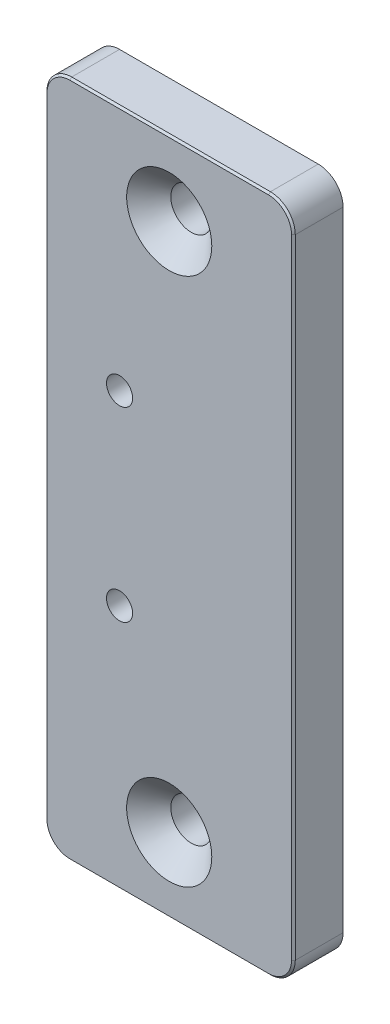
ISO-10303-21;
HEADER;
FILE_DESCRIPTION(('STEP AP214'),'2;1');
FILE_NAME('part.step','',(''),(''),'','','');
FILE_SCHEMA(('AUTOMOTIVE_DESIGN { 1 0 10303 214 1 1 1 1 }'));
ENDSEC;
DATA;
#1=APPLICATION_CONTEXT('core data for automotive mechanical design processes');
#2=APPLICATION_PROTOCOL_DEFINITION('international standard','automotive_design',2000,#1);
#3=PRODUCT_CONTEXT('',#1,'mechanical');
#4=PRODUCT('Part','Part','',(#3));
#5=PRODUCT_RELATED_PRODUCT_CATEGORY('part','',(#4));
#6=PRODUCT_DEFINITION_FORMATION('','',#4);
#7=PRODUCT_DEFINITION_CONTEXT('part definition',#1,'design');
#8=PRODUCT_DEFINITION('design','',#6,#7);
#9=PRODUCT_DEFINITION_SHAPE('','',#8);
#10=(LENGTH_UNIT() NAMED_UNIT(*) SI_UNIT(.MILLI.,.METRE.));
#11=(NAMED_UNIT(*) PLANE_ANGLE_UNIT() SI_UNIT($,.RADIAN.));
#12=(NAMED_UNIT(*) SI_UNIT($,.STERADIAN.) SOLID_ANGLE_UNIT());
#13=UNCERTAINTY_MEASURE_WITH_UNIT(LENGTH_MEASURE(1.E-05),#10,'distance_accuracy_value','');
#14=(GEOMETRIC_REPRESENTATION_CONTEXT(3) GLOBAL_UNCERTAINTY_ASSIGNED_CONTEXT((#13)) GLOBAL_UNIT_ASSIGNED_CONTEXT((#10,
#11,#12)) REPRESENTATION_CONTEXT('',''));
#15=CARTESIAN_POINT('',(0.,0.,0.));
#16=DIRECTION('',(0.,0.,1.));
#17=DIRECTION('',(1.,0.,0.));
#18=AXIS2_PLACEMENT_3D('',#15,#16,#17);
#19=CARTESIAN_POINT('',(0.,97.2,8.));
#20=DIRECTION('',(0.,0.,-1.));
#21=DIRECTION('',(-1.,0.,0.));
#22=AXIS2_PLACEMENT_3D('',#19,#20,#21);
#23=CYLINDRICAL_SURFACE('',#22,3.3);
#24=CARTESIAN_POINT('',(0.,97.2,0.));
#25=DIRECTION('',(0.,0.,1.));
#26=DIRECTION('',(1.,0.,0.));
#27=AXIS2_PLACEMENT_3D('',#24,#25,#26);
#28=CIRCLE('',#27,3.3);
#29=CARTESIAN_POINT('',(3.3,97.2,0.));
#30=VERTEX_POINT('',#29);
#31=EDGE_CURVE('E155',#30,#30,#28,.T.);
#32=ORIENTED_EDGE('',*,*,#31,.F.);
#33=EDGE_LOOP('',(#32));
#34=FACE_BOUND('',#33,.T.);
#35=CARTESIAN_POINT('',(0.,97.2,4.445));
#36=DIRECTION('',(0.,0.,1.));
#37=DIRECTION('',(1.,0.,0.));
#38=AXIS2_PLACEMENT_3D('',#35,#36,#37);
#39=CIRCLE('',#38,3.3);
#40=CARTESIAN_POINT('',(3.3,97.2,4.445));
#41=VERTEX_POINT('',#40);
#42=EDGE_CURVE('E241',#41,#41,#39,.T.);
#43=ORIENTED_EDGE('',*,*,#42,.T.);
#44=EDGE_LOOP('',(#43));
#45=FACE_BOUND('',#44,.T.);
#46=ADVANCED_FACE('F39',(#34,#45),#23,.F.);
#47=CARTESIAN_POINT('',(-16.,4.,8.));
#48=DIRECTION('',(0.,0.,1.));
#49=DIRECTION('',(1.,0.,0.));
#50=AXIS2_PLACEMENT_3D('',#47,#48,#49);
#51=PLANE('',#50);
#52=CARTESIAN_POINT('',(-8.,69.6,8.));
#53=DIRECTION('',(0.,0.,1.));
#54=DIRECTION('',(1.,0.,0.));
#55=AXIS2_PLACEMENT_3D('',#52,#53,#54);
#56=CIRCLE('',#55,2.1);
#57=CARTESIAN_POINT('',(-5.9,69.6,8.));
#58=VERTEX_POINT('',#57);
#59=EDGE_CURVE('E508',#58,#58,#56,.T.);
#60=ORIENTED_EDGE('',*,*,#59,.F.);
#61=EDGE_LOOP('',(#60));
#62=FACE_BOUND('',#61,.T.);
#63=CARTESIAN_POINT('',(-8.,39.6,8.));
#64=DIRECTION('',(0.,0.,1.));
#65=DIRECTION('',(1.,0.,0.));
#66=AXIS2_PLACEMENT_3D('',#63,#64,#65);
#67=CIRCLE('',#66,2.1);
#68=CARTESIAN_POINT('',(-5.9,39.6,8.));
#69=VERTEX_POINT('',#68);
#70=EDGE_CURVE('E511',#69,#69,#67,.T.);
#71=ORIENTED_EDGE('',*,*,#70,.F.);
#72=EDGE_LOOP('',(#71));
#73=FACE_BOUND('',#72,.T.);
#74=CARTESIAN_POINT('',(16.,4.,8.));
#75=DIRECTION('',(0.,0.,1.));
#76=DIRECTION('',(1.,0.,0.));
#77=AXIS2_PLACEMENT_3D('',#74,#75,#76);
#78=CIRCLE('',#77,3.69999999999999);
#79=CARTESIAN_POINT('',(16.,0.300000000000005,8.));
#80=VERTEX_POINT('',#79);
#81=CARTESIAN_POINT('',(19.7,4.,8.));
#82=VERTEX_POINT('',#81);
#83=EDGE_CURVE('E195',#80,#82,#78,.T.);
#84=ORIENTED_EDGE('',*,*,#83,.T.);
#85=DIRECTION('',(0.,1.,0.));
#86=VECTOR('',#85,1.);
#87=CARTESIAN_POINT('',(19.7,105.2,8.));
#88=LINE('',#87,#86);
#89=CARTESIAN_POINT('',(19.7,105.2,8.));
#90=VERTEX_POINT('',#89);
#91=EDGE_CURVE('E199',#82,#90,#88,.T.);
#92=ORIENTED_EDGE('',*,*,#91,.T.);
#93=CARTESIAN_POINT('',(16.,105.2,8.));
#94=DIRECTION('',(0.,0.,1.));
#95=DIRECTION('',(1.,0.,0.));
#96=AXIS2_PLACEMENT_3D('',#93,#94,#95);
#97=CIRCLE('',#96,3.69999999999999);
#98=CARTESIAN_POINT('',(16.,108.9,8.));
#99=VERTEX_POINT('',#98);
#100=EDGE_CURVE('E197',#90,#99,#97,.T.);
#101=ORIENTED_EDGE('',*,*,#100,.T.);
#102=DIRECTION('',(-1.,0.,0.));
#103=VECTOR('',#102,1.);
#104=CARTESIAN_POINT('',(-16.,108.9,8.));
#105=LINE('',#104,#103);
#106=CARTESIAN_POINT('',(-16.,108.9,8.));
#107=VERTEX_POINT('',#106);
#108=EDGE_CURVE('E193',#99,#107,#105,.T.);
#109=ORIENTED_EDGE('',*,*,#108,.T.);
#110=CARTESIAN_POINT('',(-16.,105.2,8.));
#111=DIRECTION('',(0.,0.,1.));
#112=DIRECTION('',(1.,0.,0.));
#113=AXIS2_PLACEMENT_3D('',#110,#111,#112);
#114=CIRCLE('',#113,3.69999999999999);
#115=CARTESIAN_POINT('',(-19.7,105.2,8.));
#116=VERTEX_POINT('',#115);
#117=EDGE_CURVE('E189',#107,#116,#114,.T.);
#118=ORIENTED_EDGE('',*,*,#117,.T.);
#119=DIRECTION('',(0.,-1.,0.));
#120=VECTOR('',#119,1.);
#121=CARTESIAN_POINT('',(-19.7,4.,8.));
#122=LINE('',#121,#120);
#123=CARTESIAN_POINT('',(-19.7,4.,8.));
#124=VERTEX_POINT('',#123);
#125=EDGE_CURVE('E136',#116,#124,#122,.T.);
#126=ORIENTED_EDGE('',*,*,#125,.T.);
#127=CARTESIAN_POINT('',(-16.,4.,8.));
#128=DIRECTION('',(0.,0.,1.));
#129=DIRECTION('',(1.,0.,0.));
#130=AXIS2_PLACEMENT_3D('',#127,#128,#129);
#131=CIRCLE('',#130,3.69999999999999);
#132=CARTESIAN_POINT('',(-16.,0.300000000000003,8.));
#133=VERTEX_POINT('',#132);
#134=EDGE_CURVE('E187',#124,#133,#131,.T.);
#135=ORIENTED_EDGE('',*,*,#134,.T.);
#136=DIRECTION('',(1.,0.,0.));
#137=VECTOR('',#136,1.);
#138=CARTESIAN_POINT('',(16.,0.300000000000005,8.));
#139=LINE('',#138,#137);
#140=EDGE_CURVE('E191',#133,#80,#139,.T.);
#141=ORIENTED_EDGE('',*,*,#140,.T.);
#142=EDGE_LOOP('',(#84,#92,#101,#109,#118,#126,#135,#141));
#143=FACE_BOUND('',#142,.T.);
#144=CARTESIAN_POINT('',(0.,97.2,8.));
#145=DIRECTION('',(0.,0.,1.));
#146=DIRECTION('',(1.,0.,0.));
#147=AXIS2_PLACEMENT_3D('',#144,#145,#146);
#148=CIRCLE('',#147,6.855);
#149=CARTESIAN_POINT('',(6.855,97.2,8.));
#150=VERTEX_POINT('',#149);
#151=EDGE_CURVE('E236',#150,#150,#148,.T.);
#152=ORIENTED_EDGE('',*,*,#151,.F.);
#153=EDGE_LOOP('',(#152));
#154=FACE_BOUND('',#153,.T.);
#155=CARTESIAN_POINT('',(0.,12.,8.));
#156=DIRECTION('',(0.,0.,1.));
#157=DIRECTION('',(1.,0.,0.));
#158=AXIS2_PLACEMENT_3D('',#155,#156,#157);
#159=CIRCLE('',#158,6.855);
#160=CARTESIAN_POINT('',(6.855,12.,8.));
#161=VERTEX_POINT('',#160);
#162=EDGE_CURVE('E246',#161,#161,#159,.T.);
#163=ORIENTED_EDGE('',*,*,#162,.F.);
#164=EDGE_LOOP('',(#163));
#165=FACE_BOUND('',#164,.T.);
#166=ADVANCED_FACE('F261',(#62,#73,#143,#154,#165),#51,.T.);
#167=CARTESIAN_POINT('',(-16.,4.,0.));
#168=DIRECTION('',(0.,0.,1.));
#169=DIRECTION('',(1.,0.,0.));
#170=AXIS2_PLACEMENT_3D('',#167,#168,#169);
#171=PLANE('',#170);
#172=CARTESIAN_POINT('',(-8.,69.6,0.));
#173=DIRECTION('',(0.,0.,1.));
#174=DIRECTION('',(1.,0.,0.));
#175=AXIS2_PLACEMENT_3D('',#172,#173,#174);
#176=CIRCLE('',#175,2.1);
#177=CARTESIAN_POINT('',(-5.9,69.6,0.));
#178=VERTEX_POINT('',#177);
#179=EDGE_CURVE('E43',#178,#178,#176,.T.);
#180=ORIENTED_EDGE('',*,*,#179,.T.);
#181=EDGE_LOOP('',(#180));
#182=FACE_BOUND('',#181,.T.);
#183=CARTESIAN_POINT('',(-8.,39.6,0.));
#184=DIRECTION('',(0.,0.,1.));
#185=DIRECTION('',(1.,0.,0.));
#186=AXIS2_PLACEMENT_3D('',#183,#184,#185);
#187=CIRCLE('',#186,2.1);
#188=CARTESIAN_POINT('',(-5.9,39.6,0.));
#189=VERTEX_POINT('',#188);
#190=EDGE_CURVE('E218',#189,#189,#187,.T.);
#191=ORIENTED_EDGE('',*,*,#190,.T.);
#192=EDGE_LOOP('',(#191));
#193=FACE_BOUND('',#192,.T.);
#194=CARTESIAN_POINT('',(-16.,4.,0.));
#195=DIRECTION('',(0.,0.,1.));
#196=DIRECTION('',(1.,0.,0.));
#197=AXIS2_PLACEMENT_3D('',#194,#195,#196);
#198=CIRCLE('',#197,4.);
#199=CARTESIAN_POINT('',(-20.,4.,0.));
#200=VERTEX_POINT('',#199);
#201=CARTESIAN_POINT('',(-16.,0.,0.));
#202=VERTEX_POINT('',#201);
#203=EDGE_CURVE('E144',#200,#202,#198,.T.);
#204=ORIENTED_EDGE('',*,*,#203,.F.);
#205=DIRECTION('',(0.,-1.,0.));
#206=VECTOR('',#205,1.);
#207=CARTESIAN_POINT('',(-20.,105.2,0.));
#208=LINE('',#207,#206);
#209=CARTESIAN_POINT('',(-20.,105.2,0.));
#210=VERTEX_POINT('',#209);
#211=EDGE_CURVE('E172',#210,#200,#208,.T.);
#212=ORIENTED_EDGE('',*,*,#211,.F.);
#213=CARTESIAN_POINT('',(-16.,105.2,0.));
#214=DIRECTION('',(0.,0.,1.));
#215=DIRECTION('',(1.,0.,0.));
#216=AXIS2_PLACEMENT_3D('',#213,#214,#215);
#217=CIRCLE('',#216,4.);
#218=CARTESIAN_POINT('',(-16.,109.2,0.));
#219=VERTEX_POINT('',#218);
#220=EDGE_CURVE('E169',#219,#210,#217,.T.);
#221=ORIENTED_EDGE('',*,*,#220,.F.);
#222=DIRECTION('',(-1.,0.,0.));
#223=VECTOR('',#222,1.);
#224=CARTESIAN_POINT('',(16.,109.2,0.));
#225=LINE('',#224,#223);
#226=CARTESIAN_POINT('',(16.,109.2,0.));
#227=VERTEX_POINT('',#226);
#228=EDGE_CURVE('E166',#227,#219,#225,.T.);
#229=ORIENTED_EDGE('',*,*,#228,.F.);
#230=CARTESIAN_POINT('',(16.,105.2,0.));
#231=DIRECTION('',(0.,0.,1.));
#232=DIRECTION('',(1.,0.,0.));
#233=AXIS2_PLACEMENT_3D('',#230,#231,#232);
#234=CIRCLE('',#233,4.);
#235=CARTESIAN_POINT('',(20.,105.2,0.));
#236=VERTEX_POINT('',#235);
#237=EDGE_CURVE('E163',#236,#227,#234,.T.);
#238=ORIENTED_EDGE('',*,*,#237,.F.);
#239=DIRECTION('',(0.,1.,0.));
#240=VECTOR('',#239,1.);
#241=CARTESIAN_POINT('',(20.,4.,0.));
#242=LINE('',#241,#240);
#243=CARTESIAN_POINT('',(20.,4.,0.));
#244=VERTEX_POINT('',#243);
#245=EDGE_CURVE('E160',#244,#236,#242,.T.);
#246=ORIENTED_EDGE('',*,*,#245,.F.);
#247=CARTESIAN_POINT('',(16.,4.,0.));
#248=DIRECTION('',(0.,0.,1.));
#249=DIRECTION('',(1.,0.,0.));
#250=AXIS2_PLACEMENT_3D('',#247,#248,#249);
#251=CIRCLE('',#250,4.);
#252=CARTESIAN_POINT('',(16.,0.,0.));
#253=VERTEX_POINT('',#252);
#254=EDGE_CURVE('E147',#253,#244,#251,.T.);
#255=ORIENTED_EDGE('',*,*,#254,.F.);
#256=DIRECTION('',(1.,0.,0.));
#257=VECTOR('',#256,1.);
#258=CARTESIAN_POINT('',(-16.,0.,0.));
#259=LINE('',#258,#257);
#260=EDGE_CURVE('E131',#202,#253,#259,.T.);
#261=ORIENTED_EDGE('',*,*,#260,.F.);
#262=EDGE_LOOP('',(#204,#212,#221,#229,#238,#246,#255,#261));
#263=FACE_BOUND('',#262,.T.);
#264=CARTESIAN_POINT('',(0.,12.,0.));
#265=DIRECTION('',(0.,0.,1.));
#266=DIRECTION('',(1.,0.,0.));
#267=AXIS2_PLACEMENT_3D('',#264,#265,#266);
#268=CIRCLE('',#267,3.3);
#269=CARTESIAN_POINT('',(3.3,12.,0.));
#270=VERTEX_POINT('',#269);
#271=EDGE_CURVE('E152',#270,#270,#268,.T.);
#272=ORIENTED_EDGE('',*,*,#271,.T.);
#273=EDGE_LOOP('',(#272));
#274=FACE_BOUND('',#273,.T.);
#275=ORIENTED_EDGE('',*,*,#31,.T.);
#276=EDGE_LOOP('',(#275));
#277=FACE_BOUND('',#276,.T.);
#278=ADVANCED_FACE('F141',(#182,#193,#263,#274,#277),#171,.F.);
#279=CARTESIAN_POINT('',(-16.,4.,8.));
#280=DIRECTION('',(0.,0.,-1.));
#281=DIRECTION('',(-1.,0.,0.));
#282=AXIS2_PLACEMENT_3D('',#279,#280,#281);
#283=CYLINDRICAL_SURFACE('',#282,4.);
#284=DIRECTION('',(0.,0.,-1.));
#285=VECTOR('',#284,1.);
#286=CARTESIAN_POINT('',(-16.,0.,8.));
#287=LINE('',#286,#285);
#288=CARTESIAN_POINT('',(-16.,0.,7.69999999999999));
#289=VERTEX_POINT('',#288);
#290=EDGE_CURVE('E127',#289,#202,#287,.T.);
#291=ORIENTED_EDGE('',*,*,#290,.F.);
#292=CARTESIAN_POINT('',(-16.,4.,7.69999999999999));
#293=DIRECTION('',(0.,0.,1.));
#294=DIRECTION('',(1.,0.,0.));
#295=AXIS2_PLACEMENT_3D('',#292,#293,#294);
#296=CIRCLE('',#295,4.);
#297=CARTESIAN_POINT('',(-20.,4.,7.69999999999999));
#298=VERTEX_POINT('',#297);
#299=EDGE_CURVE('E48',#289,#298,#296,.F.);
#300=ORIENTED_EDGE('',*,*,#299,.T.);
#301=DIRECTION('',(0.,0.,-1.));
#302=VECTOR('',#301,1.);
#303=CARTESIAN_POINT('',(-20.,4.,8.));
#304=LINE('',#303,#302);
#305=EDGE_CURVE('E150',#298,#200,#304,.T.);
#306=ORIENTED_EDGE('',*,*,#305,.T.);
#307=ORIENTED_EDGE('',*,*,#203,.T.);
#308=EDGE_LOOP('',(#291,#300,#306,#307));
#309=FACE_BOUND('',#308,.T.);
#310=ADVANCED_FACE('F149',(#309),#283,.T.);
#311=CARTESIAN_POINT('',(-16.,0.,8.));
#312=DIRECTION('',(0.,1.,0.));
#313=DIRECTION('',(0.,0.,1.));
#314=AXIS2_PLACEMENT_3D('',#311,#312,#313);
#315=PLANE('',#314);
#316=DIRECTION('',(0.,0.,-1.));
#317=VECTOR('',#316,1.);
#318=CARTESIAN_POINT('',(16.,0.,8.));
#319=LINE('',#318,#317);
#320=CARTESIAN_POINT('',(16.,0.,7.69999999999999));
#321=VERTEX_POINT('',#320);
#322=EDGE_CURVE('E137',#321,#253,#319,.T.);
#323=ORIENTED_EDGE('',*,*,#322,.F.);
#324=DIRECTION('',(-1.,0.,0.));
#325=VECTOR('',#324,1.);
#326=CARTESIAN_POINT('',(-16.,0.,7.69999999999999));
#327=LINE('',#326,#325);
#328=EDGE_CURVE('E134',#321,#289,#327,.T.);
#329=ORIENTED_EDGE('',*,*,#328,.T.);
#330=ORIENTED_EDGE('',*,*,#290,.T.);
#331=ORIENTED_EDGE('',*,*,#260,.T.);
#332=EDGE_LOOP('',(#323,#329,#330,#331));
#333=FACE_BOUND('',#332,.T.);
#334=ADVANCED_FACE('F130',(#333),#315,.F.);
#335=CARTESIAN_POINT('',(16.,4.,8.));
#336=DIRECTION('',(0.,0.,-1.));
#337=DIRECTION('',(-1.,0.,0.));
#338=AXIS2_PLACEMENT_3D('',#335,#336,#337);
#339=CYLINDRICAL_SURFACE('',#338,4.);
#340=DIRECTION('',(0.,0.,-1.));
#341=VECTOR('',#340,1.);
#342=CARTESIAN_POINT('',(20.,4.,8.));
#343=LINE('',#342,#341);
#344=CARTESIAN_POINT('',(20.,4.,7.69999999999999));
#345=VERTEX_POINT('',#344);
#346=EDGE_CURVE('E183',#345,#244,#343,.T.);
#347=ORIENTED_EDGE('',*,*,#346,.F.);
#348=CARTESIAN_POINT('',(16.,4.,7.69999999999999));
#349=DIRECTION('',(0.,0.,1.));
#350=DIRECTION('',(1.,0.,0.));
#351=AXIS2_PLACEMENT_3D('',#348,#349,#350);
#352=CIRCLE('',#351,4.);
#353=EDGE_CURVE('E207',#345,#321,#352,.F.);
#354=ORIENTED_EDGE('',*,*,#353,.T.);
#355=ORIENTED_EDGE('',*,*,#322,.T.);
#356=ORIENTED_EDGE('',*,*,#254,.T.);
#357=EDGE_LOOP('',(#347,#354,#355,#356));
#358=FACE_BOUND('',#357,.T.);
#359=ADVANCED_FACE('F309',(#358),#339,.T.);
#360=CARTESIAN_POINT('',(20.,4.,8.));
#361=DIRECTION('',(-1.,0.,0.));
#362=DIRECTION('',(0.,-1.,0.));
#363=AXIS2_PLACEMENT_3D('',#360,#361,#362);
#364=PLANE('',#363);
#365=DIRECTION('',(0.,0.,-1.));
#366=VECTOR('',#365,1.);
#367=CARTESIAN_POINT('',(20.,105.2,8.));
#368=LINE('',#367,#366);
#369=CARTESIAN_POINT('',(20.,105.2,7.69999999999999));
#370=VERTEX_POINT('',#369);
#371=EDGE_CURVE('E181',#370,#236,#368,.T.);
#372=ORIENTED_EDGE('',*,*,#371,.F.);
#373=DIRECTION('',(0.,-1.,0.));
#374=VECTOR('',#373,1.);
#375=CARTESIAN_POINT('',(20.,4.,7.69999999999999));
#376=LINE('',#375,#374);
#377=EDGE_CURVE('E202',#370,#345,#376,.T.);
#378=ORIENTED_EDGE('',*,*,#377,.T.);
#379=ORIENTED_EDGE('',*,*,#346,.T.);
#380=ORIENTED_EDGE('',*,*,#245,.T.);
#381=EDGE_LOOP('',(#372,#378,#379,#380));
#382=FACE_BOUND('',#381,.T.);
#383=ADVANCED_FACE('F305',(#382),#364,.F.);
#384=CARTESIAN_POINT('',(16.,105.2,8.));
#385=DIRECTION('',(0.,0.,-1.));
#386=DIRECTION('',(-1.,0.,0.));
#387=AXIS2_PLACEMENT_3D('',#384,#385,#386);
#388=CYLINDRICAL_SURFACE('',#387,4.);
#389=DIRECTION('',(0.,0.,-1.));
#390=VECTOR('',#389,1.);
#391=CARTESIAN_POINT('',(16.,109.2,8.));
#392=LINE('',#391,#390);
#393=CARTESIAN_POINT('',(16.,109.2,7.69999999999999));
#394=VERTEX_POINT('',#393);
#395=EDGE_CURVE('E179',#394,#227,#392,.T.);
#396=ORIENTED_EDGE('',*,*,#395,.F.);
#397=CARTESIAN_POINT('',(16.,105.2,7.69999999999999));
#398=DIRECTION('',(0.,0.,1.));
#399=DIRECTION('',(1.,0.,0.));
#400=AXIS2_PLACEMENT_3D('',#397,#398,#399);
#401=CIRCLE('',#400,4.);
#402=EDGE_CURVE('E205',#394,#370,#401,.F.);
#403=ORIENTED_EDGE('',*,*,#402,.T.);
#404=ORIENTED_EDGE('',*,*,#371,.T.);
#405=ORIENTED_EDGE('',*,*,#237,.T.);
#406=EDGE_LOOP('',(#396,#403,#404,#405));
#407=FACE_BOUND('',#406,.T.);
#408=ADVANCED_FACE('F301',(#407),#388,.T.);
#409=CARTESIAN_POINT('',(16.,109.2,8.));
#410=DIRECTION('',(0.,-1.,0.));
#411=DIRECTION('',(0.,0.,-1.));
#412=AXIS2_PLACEMENT_3D('',#409,#410,#411);
#413=PLANE('',#412);
#414=DIRECTION('',(0.,0.,-1.));
#415=VECTOR('',#414,1.);
#416=CARTESIAN_POINT('',(-16.,109.2,8.));
#417=LINE('',#416,#415);
#418=CARTESIAN_POINT('',(-16.,109.2,7.69999999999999));
#419=VERTEX_POINT('',#418);
#420=EDGE_CURVE('E177',#419,#219,#417,.T.);
#421=ORIENTED_EDGE('',*,*,#420,.F.);
#422=DIRECTION('',(1.,0.,0.));
#423=VECTOR('',#422,1.);
#424=CARTESIAN_POINT('',(16.,109.2,7.69999999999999));
#425=LINE('',#424,#423);
#426=EDGE_CURVE('E209',#419,#394,#425,.T.);
#427=ORIENTED_EDGE('',*,*,#426,.T.);
#428=ORIENTED_EDGE('',*,*,#395,.T.);
#429=ORIENTED_EDGE('',*,*,#228,.T.);
#430=EDGE_LOOP('',(#421,#427,#428,#429));
#431=FACE_BOUND('',#430,.T.);
#432=ADVANCED_FACE('F297',(#431),#413,.F.);
#433=CARTESIAN_POINT('',(-16.,105.2,8.));
#434=DIRECTION('',(0.,0.,-1.));
#435=DIRECTION('',(-1.,0.,0.));
#436=AXIS2_PLACEMENT_3D('',#433,#434,#435);
#437=CYLINDRICAL_SURFACE('',#436,4.);
#438=DIRECTION('',(0.,0.,-1.));
#439=VECTOR('',#438,1.);
#440=CARTESIAN_POINT('',(-20.,105.2,8.));
#441=LINE('',#440,#439);
#442=CARTESIAN_POINT('',(-20.,105.2,7.69999999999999));
#443=VERTEX_POINT('',#442);
#444=EDGE_CURVE('E175',#443,#210,#441,.T.);
#445=ORIENTED_EDGE('',*,*,#444,.F.);
#446=CARTESIAN_POINT('',(-16.,105.2,7.69999999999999));
#447=DIRECTION('',(0.,0.,1.));
#448=DIRECTION('',(1.,0.,0.));
#449=AXIS2_PLACEMENT_3D('',#446,#447,#448);
#450=CIRCLE('',#449,4.);
#451=EDGE_CURVE('E212',#443,#419,#450,.F.);
#452=ORIENTED_EDGE('',*,*,#451,.T.);
#453=ORIENTED_EDGE('',*,*,#420,.T.);
#454=ORIENTED_EDGE('',*,*,#220,.T.);
#455=EDGE_LOOP('',(#445,#452,#453,#454));
#456=FACE_BOUND('',#455,.T.);
#457=ADVANCED_FACE('F294',(#456),#437,.T.);
#458=CARTESIAN_POINT('',(-20.,105.2,8.));
#459=DIRECTION('',(1.,0.,0.));
#460=DIRECTION('',(0.,1.,0.));
#461=AXIS2_PLACEMENT_3D('',#458,#459,#460);
#462=PLANE('',#461);
#463=ORIENTED_EDGE('',*,*,#305,.F.);
#464=DIRECTION('',(0.,1.,0.));
#465=VECTOR('',#464,1.);
#466=CARTESIAN_POINT('',(-20.,105.2,7.69999999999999));
#467=LINE('',#466,#465);
#468=EDGE_CURVE('E11',#298,#443,#467,.T.);
#469=ORIENTED_EDGE('',*,*,#468,.T.);
#470=ORIENTED_EDGE('',*,*,#444,.T.);
#471=ORIENTED_EDGE('',*,*,#211,.T.);
#472=EDGE_LOOP('',(#463,#469,#470,#471));
#473=FACE_BOUND('',#472,.T.);
#474=ADVANCED_FACE('F284',(#473),#462,.F.);
#475=CARTESIAN_POINT('',(0.,12.,8.));
#476=DIRECTION('',(0.,0.,-1.));
#477=DIRECTION('',(-1.,0.,0.));
#478=AXIS2_PLACEMENT_3D('',#475,#476,#477);
#479=CYLINDRICAL_SURFACE('',#478,3.3);
#480=CARTESIAN_POINT('',(0.,12.,4.445));
#481=DIRECTION('',(0.,0.,1.));
#482=DIRECTION('',(1.,0.,0.));
#483=AXIS2_PLACEMENT_3D('',#480,#481,#482);
#484=CIRCLE('',#483,3.3);
#485=CARTESIAN_POINT('',(3.3,12.,4.445));
#486=VERTEX_POINT('',#485);
#487=EDGE_CURVE('E253',#486,#486,#484,.T.);
#488=ORIENTED_EDGE('',*,*,#487,.T.);
#489=EDGE_LOOP('',(#488));
#490=FACE_BOUND('',#489,.T.);
#491=ORIENTED_EDGE('',*,*,#271,.F.);
#492=EDGE_LOOP('',(#491));
#493=FACE_BOUND('',#492,.T.);
#494=ADVANCED_FACE('F275',(#490,#493),#479,.F.);
#495=CARTESIAN_POINT('',(0.,12.,8.));
#496=DIRECTION('',(0.,0.,1.));
#497=DIRECTION('',(1.,0.,0.));
#498=AXIS2_PLACEMENT_3D('',#495,#496,#497);
#499=CONICAL_SURFACE('',#498,6.855,0.785398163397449);
#500=ORIENTED_EDGE('',*,*,#487,.F.);
#501=EDGE_LOOP('',(#500));
#502=FACE_BOUND('',#501,.T.);
#503=ORIENTED_EDGE('',*,*,#162,.T.);
#504=EDGE_LOOP('',(#503));
#505=FACE_BOUND('',#504,.T.);
#506=ADVANCED_FACE('F267',(#502,#505),#499,.F.);
#507=CARTESIAN_POINT('',(0.,97.2,8.));
#508=DIRECTION('',(0.,0.,1.));
#509=DIRECTION('',(1.,0.,0.));
#510=AXIS2_PLACEMENT_3D('',#507,#508,#509);
#511=CONICAL_SURFACE('',#510,6.855,0.785398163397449);
#512=ORIENTED_EDGE('',*,*,#42,.F.);
#513=EDGE_LOOP('',(#512));
#514=FACE_BOUND('',#513,.T.);
#515=ORIENTED_EDGE('',*,*,#151,.T.);
#516=EDGE_LOOP('',(#515));
#517=FACE_BOUND('',#516,.T.);
#518=ADVANCED_FACE('F265',(#514,#517),#511,.F.);
#519=CARTESIAN_POINT('',(-19.7,4.,8.));
#520=DIRECTION('',(-0.707106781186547,0.,0.707106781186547));
#521=DIRECTION('',(0.,1.,0.));
#522=AXIS2_PLACEMENT_3D('',#519,#520,#521);
#523=PLANE('',#522);
#524=DIRECTION('',(0.707106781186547,0.,0.707106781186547));
#525=VECTOR('',#524,1.);
#526=CARTESIAN_POINT('',(-20.,105.2,7.69999999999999));
#527=LINE('',#526,#525);
#528=EDGE_CURVE('E232',#443,#116,#527,.T.);
#529=ORIENTED_EDGE('',*,*,#528,.F.);
#530=ORIENTED_EDGE('',*,*,#468,.F.);
#531=DIRECTION('',(-0.707106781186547,0.,-0.707106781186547));
#532=VECTOR('',#531,1.);
#533=CARTESIAN_POINT('',(-19.7,4.,8.));
#534=LINE('',#533,#532);
#535=EDGE_CURVE('E234',#124,#298,#534,.T.);
#536=ORIENTED_EDGE('',*,*,#535,.F.);
#537=ORIENTED_EDGE('',*,*,#125,.F.);
#538=EDGE_LOOP('',(#529,#530,#536,#537));
#539=FACE_BOUND('',#538,.T.);
#540=ADVANCED_FACE('F41',(#539),#523,.T.);
#541=CARTESIAN_POINT('',(-16.,4.,8.));
#542=DIRECTION('',(0.,0.,-1.));
#543=DIRECTION('',(-1.,0.,0.));
#544=AXIS2_PLACEMENT_3D('',#541,#542,#543);
#545=CONICAL_SURFACE('',#544,3.69999999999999,0.785398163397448);
#546=ORIENTED_EDGE('',*,*,#535,.T.);
#547=ORIENTED_EDGE('',*,*,#299,.F.);
#548=DIRECTION('',(0.,-0.707106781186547,-0.707106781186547));
#549=VECTOR('',#548,1.);
#550=CARTESIAN_POINT('',(-16.,0.300000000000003,8.));
#551=LINE('',#550,#549);
#552=EDGE_CURVE('E229',#133,#289,#551,.T.);
#553=ORIENTED_EDGE('',*,*,#552,.F.);
#554=ORIENTED_EDGE('',*,*,#134,.F.);
#555=EDGE_LOOP('',(#546,#547,#553,#554));
#556=FACE_BOUND('',#555,.T.);
#557=ADVANCED_FACE('F273',(#556),#545,.T.);
#558=CARTESIAN_POINT('',(-16.,105.2,8.));
#559=DIRECTION('',(0.,0.,-1.));
#560=DIRECTION('',(-1.,0.,0.));
#561=AXIS2_PLACEMENT_3D('',#558,#559,#560);
#562=CONICAL_SURFACE('',#561,3.69999999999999,0.785398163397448);
#563=ORIENTED_EDGE('',*,*,#528,.T.);
#564=ORIENTED_EDGE('',*,*,#117,.F.);
#565=DIRECTION('',(0.,-0.707106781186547,0.707106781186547));
#566=VECTOR('',#565,1.);
#567=CARTESIAN_POINT('',(-16.,109.2,7.69999999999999));
#568=LINE('',#567,#566);
#569=EDGE_CURVE('E226',#419,#107,#568,.T.);
#570=ORIENTED_EDGE('',*,*,#569,.F.);
#571=ORIENTED_EDGE('',*,*,#451,.F.);
#572=EDGE_LOOP('',(#563,#564,#570,#571));
#573=FACE_BOUND('',#572,.T.);
#574=ADVANCED_FACE('F337',(#573),#562,.T.);
#575=CARTESIAN_POINT('',(-16.,0.300000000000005,8.));
#576=DIRECTION('',(0.,-0.707106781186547,0.707106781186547));
#577=DIRECTION('',(-1.,0.,0.));
#578=AXIS2_PLACEMENT_3D('',#575,#576,#577);
#579=PLANE('',#578);
#580=ORIENTED_EDGE('',*,*,#552,.T.);
#581=ORIENTED_EDGE('',*,*,#328,.F.);
#582=DIRECTION('',(0.,-0.707106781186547,-0.707106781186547));
#583=VECTOR('',#582,1.);
#584=CARTESIAN_POINT('',(16.,0.300000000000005,8.));
#585=LINE('',#584,#583);
#586=EDGE_CURVE('E223',#80,#321,#585,.T.);
#587=ORIENTED_EDGE('',*,*,#586,.F.);
#588=ORIENTED_EDGE('',*,*,#140,.F.);
#589=EDGE_LOOP('',(#580,#581,#587,#588));
#590=FACE_BOUND('',#589,.T.);
#591=ADVANCED_FACE('F333',(#590),#579,.T.);
#592=CARTESIAN_POINT('',(-16.,108.9,8.));
#593=DIRECTION('',(0.,0.707106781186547,0.707106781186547));
#594=DIRECTION('',(1.,0.,0.));
#595=AXIS2_PLACEMENT_3D('',#592,#593,#594);
#596=PLANE('',#595);
#597=ORIENTED_EDGE('',*,*,#569,.T.);
#598=ORIENTED_EDGE('',*,*,#108,.F.);
#599=DIRECTION('',(0.,-0.707106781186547,0.707106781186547));
#600=VECTOR('',#599,1.);
#601=CARTESIAN_POINT('',(16.,109.2,7.69999999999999));
#602=LINE('',#601,#600);
#603=EDGE_CURVE('E220',#394,#99,#602,.T.);
#604=ORIENTED_EDGE('',*,*,#603,.F.);
#605=ORIENTED_EDGE('',*,*,#426,.F.);
#606=EDGE_LOOP('',(#597,#598,#604,#605));
#607=FACE_BOUND('',#606,.T.);
#608=ADVANCED_FACE('F329',(#607),#596,.T.);
#609=CARTESIAN_POINT('',(16.,4.,8.));
#610=DIRECTION('',(0.,0.,-1.));
#611=DIRECTION('',(-1.,0.,0.));
#612=AXIS2_PLACEMENT_3D('',#609,#610,#611);
#613=CONICAL_SURFACE('',#612,3.69999999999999,0.785398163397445);
#614=ORIENTED_EDGE('',*,*,#586,.T.);
#615=ORIENTED_EDGE('',*,*,#353,.F.);
#616=DIRECTION('',(0.707106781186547,0.,-0.707106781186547));
#617=VECTOR('',#616,1.);
#618=CARTESIAN_POINT('',(19.7,4.,8.));
#619=LINE('',#618,#617);
#620=EDGE_CURVE('E217',#82,#345,#619,.T.);
#621=ORIENTED_EDGE('',*,*,#620,.F.);
#622=ORIENTED_EDGE('',*,*,#83,.F.);
#623=EDGE_LOOP('',(#614,#615,#621,#622));
#624=FACE_BOUND('',#623,.T.);
#625=ADVANCED_FACE('F325',(#624),#613,.T.);
#626=CARTESIAN_POINT('',(16.,105.2,8.));
#627=DIRECTION('',(0.,0.,-1.));
#628=DIRECTION('',(-1.,0.,0.));
#629=AXIS2_PLACEMENT_3D('',#626,#627,#628);
#630=CONICAL_SURFACE('',#629,3.69999999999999,0.785398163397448);
#631=ORIENTED_EDGE('',*,*,#603,.T.);
#632=ORIENTED_EDGE('',*,*,#100,.F.);
#633=DIRECTION('',(-0.707106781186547,0.,0.707106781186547));
#634=VECTOR('',#633,1.);
#635=CARTESIAN_POINT('',(20.,105.2,7.69999999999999));
#636=LINE('',#635,#634);
#637=EDGE_CURVE('E215',#370,#90,#636,.T.);
#638=ORIENTED_EDGE('',*,*,#637,.F.);
#639=ORIENTED_EDGE('',*,*,#402,.F.);
#640=EDGE_LOOP('',(#631,#632,#638,#639));
#641=FACE_BOUND('',#640,.T.);
#642=ADVANCED_FACE('F321',(#641),#630,.T.);
#643=CARTESIAN_POINT('',(19.7,3.99999999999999,8.));
#644=DIRECTION('',(0.707106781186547,0.,0.707106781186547));
#645=DIRECTION('',(0.,-1.,0.));
#646=AXIS2_PLACEMENT_3D('',#643,#644,#645);
#647=PLANE('',#646);
#648=ORIENTED_EDGE('',*,*,#620,.T.);
#649=ORIENTED_EDGE('',*,*,#377,.F.);
#650=ORIENTED_EDGE('',*,*,#637,.T.);
#651=ORIENTED_EDGE('',*,*,#91,.F.);
#652=EDGE_LOOP('',(#648,#649,#650,#651));
#653=FACE_BOUND('',#652,.T.);
#654=ADVANCED_FACE('F318',(#653),#647,.T.);
#655=CARTESIAN_POINT('',(-8.,39.6,8.));
#656=DIRECTION('',(0.,0.,1.));
#657=DIRECTION('',(1.,0.,0.));
#658=AXIS2_PLACEMENT_3D('',#655,#656,#657);
#659=CYLINDRICAL_SURFACE('',#658,2.1);
#660=ORIENTED_EDGE('',*,*,#70,.T.);
#661=EDGE_LOOP('',(#660));
#662=FACE_BOUND('',#661,.T.);
#663=ORIENTED_EDGE('',*,*,#190,.F.);
#664=EDGE_LOOP('',(#663));
#665=FACE_BOUND('',#664,.T.);
#666=ADVANCED_FACE('F279',(#662,#665),#659,.F.);
#667=CARTESIAN_POINT('',(-8.,69.6,8.));
#668=DIRECTION('',(0.,0.,1.));
#669=DIRECTION('',(1.,0.,0.));
#670=AXIS2_PLACEMENT_3D('',#667,#668,#669);
#671=CYLINDRICAL_SURFACE('',#670,2.1);
#672=ORIENTED_EDGE('',*,*,#59,.T.);
#673=EDGE_LOOP('',(#672));
#674=FACE_BOUND('',#673,.T.);
#675=ORIENTED_EDGE('',*,*,#179,.F.);
#676=EDGE_LOOP('',(#675));
#677=FACE_BOUND('',#676,.T.);
#678=ADVANCED_FACE('F377',(#674,#677),#671,.F.);
#679=CLOSED_SHELL('',(#46,#166,#278,#310,#334,#359,#383,#408,#432,#457,#474,#494,#506,#518,#540,
#557,#574,#591,#608,#625,#642,#654,#666,#678));
#680=MANIFOLD_SOLID_BREP('B2',#679);
#681=ADVANCED_BREP_SHAPE_REPRESENTATION('',(#18,#680),#14);
#682=SHAPE_DEFINITION_REPRESENTATION(#9,#681);
ENDSEC;
END-ISO-10303-21;
